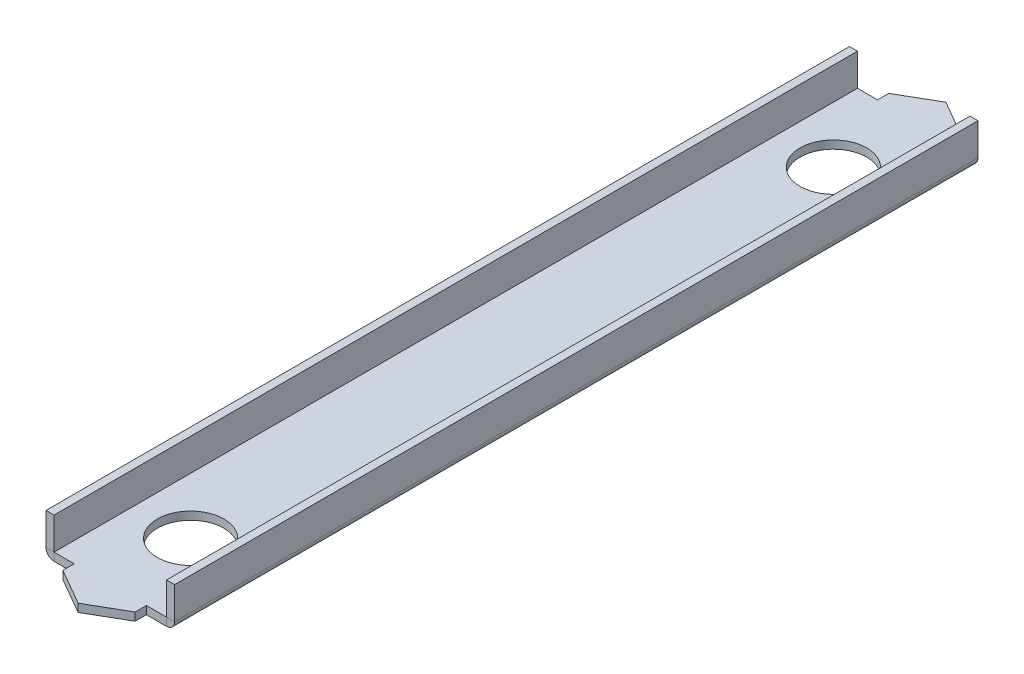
ISO-10303-21;
HEADER;
FILE_DESCRIPTION(('STEP AP214'),'2;1');
FILE_NAME('part.step','',(''),(''),'','','');
FILE_SCHEMA(('AUTOMOTIVE_DESIGN { 1 0 10303 214 1 1 1 1 }'));
ENDSEC;
DATA;
#1=APPLICATION_CONTEXT('core data for automotive mechanical design processes');
#2=APPLICATION_PROTOCOL_DEFINITION('international standard','automotive_design',2000,#1);
#3=PRODUCT_CONTEXT('',#1,'mechanical');
#4=PRODUCT('Part','Part','',(#3));
#5=PRODUCT_RELATED_PRODUCT_CATEGORY('part','',(#4));
#6=PRODUCT_DEFINITION_FORMATION('','',#4);
#7=PRODUCT_DEFINITION_CONTEXT('part definition',#1,'design');
#8=PRODUCT_DEFINITION('design','',#6,#7);
#9=PRODUCT_DEFINITION_SHAPE('','',#8);
#10=(LENGTH_UNIT() NAMED_UNIT(*) SI_UNIT(.MILLI.,.METRE.));
#11=(NAMED_UNIT(*) PLANE_ANGLE_UNIT() SI_UNIT($,.RADIAN.));
#12=(NAMED_UNIT(*) SI_UNIT($,.STERADIAN.) SOLID_ANGLE_UNIT());
#13=UNCERTAINTY_MEASURE_WITH_UNIT(LENGTH_MEASURE(1.E-05),#10,'distance_accuracy_value','');
#14=(GEOMETRIC_REPRESENTATION_CONTEXT(3) GLOBAL_UNCERTAINTY_ASSIGNED_CONTEXT((#13)) GLOBAL_UNIT_ASSIGNED_CONTEXT((#10,
#11,#12)) REPRESENTATION_CONTEXT('',''));
#15=CARTESIAN_POINT('',(0.,0.,0.));
#16=DIRECTION('',(0.,0.,1.));
#17=DIRECTION('',(1.,0.,0.));
#18=AXIS2_PLACEMENT_3D('',#15,#16,#17);
#19=CARTESIAN_POINT('',(-6.99899999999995,-2.28539816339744,50.));
#20=DIRECTION('',(0.,0.,1.));
#21=DIRECTION('',(0.,-1.,0.));
#22=AXIS2_PLACEMENT_3D('',#19,#20,#21);
#23=PLANE('',#22);
#24=DIRECTION('',(0.,1.,0.));
#25=VECTOR('',#24,1.);
#26=CARTESIAN_POINT('',(-8.00000000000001,-2.28539816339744,50.));
#27=LINE('',#26,#25);
#28=CARTESIAN_POINT('',(-8.00000000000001,1.,50.0000000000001));
#29=VERTEX_POINT('',#28);
#30=CARTESIAN_POINT('',(-8.00000000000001,5.00000000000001,50.0000000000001));
#31=VERTEX_POINT('',#30);
#32=EDGE_CURVE('E207',#29,#31,#27,.T.);
#33=ORIENTED_EDGE('',*,*,#32,.F.);
#34=DIRECTION('',(1.,0.,0.));
#35=VECTOR('',#34,1.);
#36=CARTESIAN_POINT('',(-6.99899999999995,1.,50.0000000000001));
#37=LINE('',#36,#35);
#38=CARTESIAN_POINT('',(-7.00000000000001,1.,50.0000000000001));
#39=VERTEX_POINT('',#38);
#40=EDGE_CURVE('E11',#29,#39,#37,.T.);
#41=ORIENTED_EDGE('',*,*,#40,.T.);
#42=DIRECTION('',(0.,1.,0.));
#43=VECTOR('',#42,1.);
#44=CARTESIAN_POINT('',(-7.00000000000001,-2.28539816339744,50.));
#45=LINE('',#44,#43);
#46=CARTESIAN_POINT('',(-7.00000000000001,5.00000000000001,50.0000000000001));
#47=VERTEX_POINT('',#46);
#48=EDGE_CURVE('E205',#39,#47,#45,.T.);
#49=ORIENTED_EDGE('',*,*,#48,.T.);
#50=DIRECTION('',(-1.,0.,0.));
#51=VECTOR('',#50,1.);
#52=CARTESIAN_POINT('',(-6.99899999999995,5.00000000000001,50.0000000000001));
#53=LINE('',#52,#51);
#54=EDGE_CURVE('E211',#47,#31,#53,.T.);
#55=ORIENTED_EDGE('',*,*,#54,.T.);
#56=EDGE_LOOP('',(#33,#41,#49,#55));
#57=FACE_BOUND('',#56,.T.);
#58=ADVANCED_FACE('F29',(#57),#23,.T.);
#59=CARTESIAN_POINT('',(-6.99899999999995,-2.28539816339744,-50.));
#60=DIRECTION('',(0.,0.,-1.));
#61=DIRECTION('',(0.,1.,0.));
#62=AXIS2_PLACEMENT_3D('',#59,#60,#61);
#63=PLANE('',#62);
#64=DIRECTION('',(0.,-1.,0.));
#65=VECTOR('',#64,1.);
#66=CARTESIAN_POINT('',(-7.00000000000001,-2.28539816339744,-50.));
#67=LINE('',#66,#65);
#68=CARTESIAN_POINT('',(-7.00000000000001,5.00000000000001,-50.));
#69=VERTEX_POINT('',#68);
#70=CARTESIAN_POINT('',(-7.00000000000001,1.,-50.));
#71=VERTEX_POINT('',#70);
#72=EDGE_CURVE('E224',#69,#71,#67,.T.);
#73=ORIENTED_EDGE('',*,*,#72,.T.);
#74=DIRECTION('',(-1.,0.,0.));
#75=VECTOR('',#74,1.);
#76=CARTESIAN_POINT('',(-6.99899999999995,1.,-50.));
#77=LINE('',#76,#75);
#78=CARTESIAN_POINT('',(-8.00000000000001,1.00000000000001,-50.));
#79=VERTEX_POINT('',#78);
#80=EDGE_CURVE('E37',#71,#79,#77,.T.);
#81=ORIENTED_EDGE('',*,*,#80,.T.);
#82=DIRECTION('',(0.,-1.,0.));
#83=VECTOR('',#82,1.);
#84=CARTESIAN_POINT('',(-8.00000000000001,-2.28539816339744,-50.));
#85=LINE('',#84,#83);
#86=CARTESIAN_POINT('',(-8.00000000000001,5.00000000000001,-50.));
#87=VERTEX_POINT('',#86);
#88=EDGE_CURVE('E219',#87,#79,#85,.T.);
#89=ORIENTED_EDGE('',*,*,#88,.F.);
#90=DIRECTION('',(-1.,0.,0.));
#91=VECTOR('',#90,1.);
#92=CARTESIAN_POINT('',(-6.99899999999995,5.00000000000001,-50.));
#93=LINE('',#92,#91);
#94=EDGE_CURVE('E222',#69,#87,#93,.T.);
#95=ORIENTED_EDGE('',*,*,#94,.F.);
#96=EDGE_LOOP('',(#73,#81,#89,#95));
#97=FACE_BOUND('',#96,.T.);
#98=ADVANCED_FACE('F232',(#97),#63,.T.);
#99=CARTESIAN_POINT('',(-8.00000000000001,0.,55.));
#100=DIRECTION('',(1.,0.,0.));
#101=DIRECTION('',(0.,0.,-1.));
#102=AXIS2_PLACEMENT_3D('',#99,#100,#101);
#103=PLANE('',#102);
#104=ORIENTED_EDGE('',*,*,#32,.T.);
#105=DIRECTION('',(0.,0.,-1.));
#106=VECTOR('',#105,1.);
#107=CARTESIAN_POINT('',(-8.00000000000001,5.,55.0000000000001));
#108=LINE('',#107,#106);
#109=EDGE_CURVE('E226',#31,#87,#108,.T.);
#110=ORIENTED_EDGE('',*,*,#109,.T.);
#111=ORIENTED_EDGE('',*,*,#88,.T.);
#112=DIRECTION('',(0.,0.,-1.));
#113=VECTOR('',#112,1.);
#114=CARTESIAN_POINT('',(-8.00000000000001,1.,55.0000000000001));
#115=LINE('',#114,#113);
#116=EDGE_CURVE('E44',#29,#79,#115,.T.);
#117=ORIENTED_EDGE('',*,*,#116,.F.);
#118=EDGE_LOOP('',(#104,#110,#111,#117));
#119=FACE_BOUND('',#118,.T.);
#120=ADVANCED_FACE('F236',(#119),#103,.F.);
#121=CARTESIAN_POINT('',(213.145406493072,5.,55.0000000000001));
#122=DIRECTION('',(0.,1.,0.));
#123=DIRECTION('',(-1.,0.,0.));
#124=AXIS2_PLACEMENT_3D('',#121,#122,#123);
#125=PLANE('',#124);
#126=ORIENTED_EDGE('',*,*,#109,.F.);
#127=ORIENTED_EDGE('',*,*,#54,.F.);
#128=DIRECTION('',(0.,0.,-1.));
#129=VECTOR('',#128,1.);
#130=CARTESIAN_POINT('',(-7.00000000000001,5.,55.0000000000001));
#131=LINE('',#130,#129);
#132=EDGE_CURVE('E52',#47,#69,#131,.T.);
#133=ORIENTED_EDGE('',*,*,#132,.T.);
#134=ORIENTED_EDGE('',*,*,#94,.T.);
#135=EDGE_LOOP('',(#126,#127,#133,#134));
#136=FACE_BOUND('',#135,.T.);
#137=ADVANCED_FACE('F31',(#136),#125,.T.);
#138=CARTESIAN_POINT('',(-7.00000000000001,0.,55.0000000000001));
#139=DIRECTION('',(1.,0.,0.));
#140=DIRECTION('',(0.,0.,-1.));
#141=AXIS2_PLACEMENT_3D('',#138,#139,#140);
#142=PLANE('',#141);
#143=ORIENTED_EDGE('',*,*,#132,.F.);
#144=ORIENTED_EDGE('',*,*,#48,.F.);
#145=DIRECTION('',(0.,0.,-1.));
#146=VECTOR('',#145,1.);
#147=CARTESIAN_POINT('',(-7.00000000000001,1.,55.0000000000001));
#148=LINE('',#147,#146);
#149=EDGE_CURVE('E171',#39,#71,#148,.T.);
#150=ORIENTED_EDGE('',*,*,#149,.T.);
#151=ORIENTED_EDGE('',*,*,#72,.F.);
#152=EDGE_LOOP('',(#143,#144,#150,#151));
#153=FACE_BOUND('',#152,.T.);
#154=ADVANCED_FACE('F208',(#153),#142,.T.);
#155=CARTESIAN_POINT('',(6.99899999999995,-2.28539816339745,50.0000000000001));
#156=DIRECTION('',(0.,0.,1.));
#157=DIRECTION('',(0.,1.,0.));
#158=AXIS2_PLACEMENT_3D('',#155,#156,#157);
#159=PLANE('',#158);
#160=DIRECTION('',(0.,-1.,0.));
#161=VECTOR('',#160,1.);
#162=CARTESIAN_POINT('',(7.00000000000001,-2.28539816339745,50.0000000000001));
#163=LINE('',#162,#161);
#164=CARTESIAN_POINT('',(7.00000000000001,5.,50.0000000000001));
#165=VERTEX_POINT('',#164);
#166=CARTESIAN_POINT('',(7.00000000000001,1.,50.0000000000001));
#167=VERTEX_POINT('',#166);
#168=EDGE_CURVE('E473',#165,#167,#163,.T.);
#169=ORIENTED_EDGE('',*,*,#168,.T.);
#170=DIRECTION('',(1.,0.,0.));
#171=VECTOR('',#170,1.);
#172=CARTESIAN_POINT('',(6.99899999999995,1.,50.0000000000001));
#173=LINE('',#172,#171);
#174=CARTESIAN_POINT('',(8.00000000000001,1.,50.0000000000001));
#175=VERTEX_POINT('',#174);
#176=EDGE_CURVE('E209',#167,#175,#173,.T.);
#177=ORIENTED_EDGE('',*,*,#176,.T.);
#178=DIRECTION('',(0.,-1.,0.));
#179=VECTOR('',#178,1.);
#180=CARTESIAN_POINT('',(8.00000000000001,-2.28539816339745,50.0000000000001));
#181=LINE('',#180,#179);
#182=CARTESIAN_POINT('',(8.00000000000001,5.,50.0000000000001));
#183=VERTEX_POINT('',#182);
#184=EDGE_CURVE('E200',#183,#175,#181,.T.);
#185=ORIENTED_EDGE('',*,*,#184,.F.);
#186=DIRECTION('',(1.,0.,0.));
#187=VECTOR('',#186,1.);
#188=CARTESIAN_POINT('',(6.99899999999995,5.,50.0000000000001));
#189=LINE('',#188,#187);
#190=EDGE_CURVE('E470',#165,#183,#189,.T.);
#191=ORIENTED_EDGE('',*,*,#190,.F.);
#192=EDGE_LOOP('',(#169,#177,#185,#191));
#193=FACE_BOUND('',#192,.T.);
#194=ADVANCED_FACE('F243',(#193),#159,.T.);
#195=CARTESIAN_POINT('',(6.99899999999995,-2.28539816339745,-49.9999999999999));
#196=DIRECTION('',(0.,0.,-1.));
#197=DIRECTION('',(0.,-1.,0.));
#198=AXIS2_PLACEMENT_3D('',#195,#196,#197);
#199=PLANE('',#198);
#200=DIRECTION('',(0.,1.,0.));
#201=VECTOR('',#200,1.);
#202=CARTESIAN_POINT('',(8.00000000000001,-2.28539816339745,-49.9999999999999));
#203=LINE('',#202,#201);
#204=CARTESIAN_POINT('',(8.00000000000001,1.00000000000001,-49.9999999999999));
#205=VERTEX_POINT('',#204);
#206=CARTESIAN_POINT('',(8.00000000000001,5.,-49.9999999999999));
#207=VERTEX_POINT('',#206);
#208=EDGE_CURVE('E479',#205,#207,#203,.T.);
#209=ORIENTED_EDGE('',*,*,#208,.F.);
#210=DIRECTION('',(-1.,0.,0.));
#211=VECTOR('',#210,1.);
#212=CARTESIAN_POINT('',(6.99899999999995,1.00000000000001,-49.9999999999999));
#213=LINE('',#212,#211);
#214=CARTESIAN_POINT('',(7.00000000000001,1.00000000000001,-49.9999999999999));
#215=VERTEX_POINT('',#214);
#216=EDGE_CURVE('E214',#205,#215,#213,.T.);
#217=ORIENTED_EDGE('',*,*,#216,.T.);
#218=DIRECTION('',(0.,1.,0.));
#219=VECTOR('',#218,1.);
#220=CARTESIAN_POINT('',(7.00000000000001,-2.28539816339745,-49.9999999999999));
#221=LINE('',#220,#219);
#222=CARTESIAN_POINT('',(7.00000000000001,5.,-49.9999999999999));
#223=VERTEX_POINT('',#222);
#224=EDGE_CURVE('E476',#215,#223,#221,.T.);
#225=ORIENTED_EDGE('',*,*,#224,.T.);
#226=DIRECTION('',(1.,0.,0.));
#227=VECTOR('',#226,1.);
#228=CARTESIAN_POINT('',(6.99899999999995,5.,-49.9999999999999));
#229=LINE('',#228,#227);
#230=EDGE_CURVE('E482',#223,#207,#229,.T.);
#231=ORIENTED_EDGE('',*,*,#230,.T.);
#232=EDGE_LOOP('',(#209,#217,#225,#231));
#233=FACE_BOUND('',#232,.T.);
#234=ADVANCED_FACE('F256',(#233),#199,.T.);
#235=CARTESIAN_POINT('',(-213.145406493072,5.,55.0000000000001));
#236=DIRECTION('',(0.,-1.,0.));
#237=DIRECTION('',(1.,0.,0.));
#238=AXIS2_PLACEMENT_3D('',#235,#236,#237);
#239=PLANE('',#238);
#240=ORIENTED_EDGE('',*,*,#190,.T.);
#241=DIRECTION('',(0.,0.,-1.));
#242=VECTOR('',#241,1.);
#243=CARTESIAN_POINT('',(8.00000000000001,5.,55.0000000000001));
#244=LINE('',#243,#242);
#245=EDGE_CURVE('E485',#183,#207,#244,.T.);
#246=ORIENTED_EDGE('',*,*,#245,.T.);
#247=ORIENTED_EDGE('',*,*,#230,.F.);
#248=DIRECTION('',(0.,0.,-1.));
#249=VECTOR('',#248,1.);
#250=CARTESIAN_POINT('',(7.00000000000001,5.,55.0000000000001));
#251=LINE('',#250,#249);
#252=EDGE_CURVE('E493',#165,#223,#251,.T.);
#253=ORIENTED_EDGE('',*,*,#252,.F.);
#254=EDGE_LOOP('',(#240,#246,#247,#253));
#255=FACE_BOUND('',#254,.T.);
#256=ADVANCED_FACE('F252',(#255),#239,.F.);
#257=CARTESIAN_POINT('',(7.00000000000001,0.,55.0000000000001));
#258=DIRECTION('',(-1.,0.,0.));
#259=DIRECTION('',(0.,0.,1.));
#260=AXIS2_PLACEMENT_3D('',#257,#258,#259);
#261=PLANE('',#260);
#262=DIRECTION('',(0.,0.,-1.));
#263=VECTOR('',#262,1.);
#264=CARTESIAN_POINT('',(7.00000000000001,1.,55.0000000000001));
#265=LINE('',#264,#263);
#266=EDGE_CURVE('E490',#167,#215,#265,.T.);
#267=ORIENTED_EDGE('',*,*,#266,.F.);
#268=ORIENTED_EDGE('',*,*,#168,.F.);
#269=ORIENTED_EDGE('',*,*,#252,.T.);
#270=ORIENTED_EDGE('',*,*,#224,.F.);
#271=EDGE_LOOP('',(#267,#268,#269,#270));
#272=FACE_BOUND('',#271,.T.);
#273=ADVANCED_FACE('F255',(#272),#261,.T.);
#274=CARTESIAN_POINT('',(8.00000000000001,0.,55.0000000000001));
#275=DIRECTION('',(-1.,0.,0.));
#276=DIRECTION('',(0.,0.,1.));
#277=AXIS2_PLACEMENT_3D('',#274,#275,#276);
#278=PLANE('',#277);
#279=ORIENTED_EDGE('',*,*,#184,.T.);
#280=DIRECTION('',(0.,0.,-1.));
#281=VECTOR('',#280,1.);
#282=CARTESIAN_POINT('',(8.00000000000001,1.,55.0000000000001));
#283=LINE('',#282,#281);
#284=EDGE_CURVE('E487',#175,#205,#283,.T.);
#285=ORIENTED_EDGE('',*,*,#284,.T.);
#286=ORIENTED_EDGE('',*,*,#208,.T.);
#287=ORIENTED_EDGE('',*,*,#245,.F.);
#288=EDGE_LOOP('',(#279,#285,#286,#287));
#289=FACE_BOUND('',#288,.T.);
#290=ADVANCED_FACE('F260',(#289),#278,.F.);
#291=CARTESIAN_POINT('',(-8.00000000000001,1.,55.0000000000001));
#292=DIRECTION('',(0.,1.,0.));
#293=DIRECTION('',(-1.,0.,0.));
#294=AXIS2_PLACEMENT_3D('',#291,#292,#293);
#295=PLANE('',#294);
#296=CARTESIAN_POINT('',(0.,1.00000000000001,-39.9999999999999));
#297=DIRECTION('',(0.,1.,0.));
#298=DIRECTION('',(-1.,0.,0.));
#299=AXIS2_PLACEMENT_3D('',#296,#297,#298);
#300=CIRCLE('',#299,4.15);
#301=CARTESIAN_POINT('',(-4.15,1.00000000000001,-39.9999999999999));
#302=VERTEX_POINT('',#301);
#303=EDGE_CURVE('E454',#302,#302,#300,.T.);
#304=ORIENTED_EDGE('',*,*,#303,.F.);
#305=EDGE_LOOP('',(#304));
#306=FACE_BOUND('',#305,.T.);
#307=CARTESIAN_POINT('',(0.,1.00000000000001,40.0000000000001));
#308=DIRECTION('',(0.,1.,0.));
#309=DIRECTION('',(-1.,0.,0.));
#310=AXIS2_PLACEMENT_3D('',#307,#308,#309);
#311=CIRCLE('',#310,4.15);
#312=CARTESIAN_POINT('',(-4.15,1.00000000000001,40.0000000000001));
#313=VERTEX_POINT('',#312);
#314=EDGE_CURVE('E448',#313,#313,#311,.T.);
#315=ORIENTED_EDGE('',*,*,#314,.F.);
#316=EDGE_LOOP('',(#315));
#317=FACE_BOUND('',#316,.T.);
#318=ORIENTED_EDGE('',*,*,#149,.F.);
#319=DIRECTION('',(-1.,0.,0.));
#320=VECTOR('',#319,1.);
#321=CARTESIAN_POINT('',(-4.5,1.00000000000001,50.0000000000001));
#322=LINE('',#321,#320);
#323=CARTESIAN_POINT('',(-4.5,1.00000000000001,50.0000000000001));
#324=VERTEX_POINT('',#323);
#325=EDGE_CURVE('E175',#324,#39,#322,.T.);
#326=ORIENTED_EDGE('',*,*,#325,.F.);
#327=DIRECTION('',(0.,0.,-1.));
#328=VECTOR('',#327,1.);
#329=CARTESIAN_POINT('',(-4.5,1.00000000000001,51.4019237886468));
#330=LINE('',#329,#328);
#331=CARTESIAN_POINT('',(-4.5,1.00000000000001,51.4019237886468));
#332=VERTEX_POINT('',#331);
#333=EDGE_CURVE('E194',#332,#324,#330,.T.);
#334=ORIENTED_EDGE('',*,*,#333,.F.);
#335=DIRECTION('',(-0.866025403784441,0.,-0.499999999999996));
#336=VECTOR('',#335,1.);
#337=CARTESIAN_POINT('',(0.,1.,54.0000000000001));
#338=LINE('',#337,#336);
#339=CARTESIAN_POINT('',(0.,1.,54.0000000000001));
#340=VERTEX_POINT('',#339);
#341=EDGE_CURVE('E370',#340,#332,#338,.T.);
#342=ORIENTED_EDGE('',*,*,#341,.F.);
#343=DIRECTION('',(-0.86602540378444,0.,0.499999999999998));
#344=VECTOR('',#343,1.);
#345=CARTESIAN_POINT('',(0.,1.,54.0000000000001));
#346=LINE('',#345,#344);
#347=CARTESIAN_POINT('',(4.5,1.00000000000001,51.4019237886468));
#348=VERTEX_POINT('',#347);
#349=EDGE_CURVE('E399',#348,#340,#346,.T.);
#350=ORIENTED_EDGE('',*,*,#349,.F.);
#351=DIRECTION('',(0.,0.,1.));
#352=VECTOR('',#351,1.);
#353=CARTESIAN_POINT('',(4.5,1.00000000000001,51.4019237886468));
#354=LINE('',#353,#352);
#355=CARTESIAN_POINT('',(4.5,1.00000000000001,50.0000000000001));
#356=VERTEX_POINT('',#355);
#357=EDGE_CURVE('E363',#356,#348,#354,.T.);
#358=ORIENTED_EDGE('',*,*,#357,.F.);
#359=DIRECTION('',(-1.,0.,0.));
#360=VECTOR('',#359,1.);
#361=CARTESIAN_POINT('',(4.5,1.00000000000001,50.0000000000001));
#362=LINE('',#361,#360);
#363=EDGE_CURVE('E367',#167,#356,#362,.T.);
#364=ORIENTED_EDGE('',*,*,#363,.F.);
#365=ORIENTED_EDGE('',*,*,#266,.T.);
#366=DIRECTION('',(1.,0.,0.));
#367=VECTOR('',#366,1.);
#368=CARTESIAN_POINT('',(4.5,1.00000000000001,-50.));
#369=LINE('',#368,#367);
#370=CARTESIAN_POINT('',(4.5,1.00000000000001,-50.));
#371=VERTEX_POINT('',#370);
#372=EDGE_CURVE('E412',#371,#215,#369,.T.);
#373=ORIENTED_EDGE('',*,*,#372,.F.);
#374=DIRECTION('',(0.,0.,1.));
#375=VECTOR('',#374,1.);
#376=CARTESIAN_POINT('',(4.5,1.00000000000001,-51.4019237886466));
#377=LINE('',#376,#375);
#378=CARTESIAN_POINT('',(4.5,1.00000000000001,-51.4019237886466));
#379=VERTEX_POINT('',#378);
#380=EDGE_CURVE('E409',#379,#371,#377,.T.);
#381=ORIENTED_EDGE('',*,*,#380,.F.);
#382=DIRECTION('',(0.86602540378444,0.,0.499999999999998));
#383=VECTOR('',#382,1.);
#384=CARTESIAN_POINT('',(0.,1.00000000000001,-54.));
#385=LINE('',#384,#383);
#386=CARTESIAN_POINT('',(0.,1.00000000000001,-54.));
#387=VERTEX_POINT('',#386);
#388=EDGE_CURVE('E406',#387,#379,#385,.T.);
#389=ORIENTED_EDGE('',*,*,#388,.F.);
#390=DIRECTION('',(0.866025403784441,0.,-0.499999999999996));
#391=VECTOR('',#390,1.);
#392=CARTESIAN_POINT('',(0.,1.00000000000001,-54.));
#393=LINE('',#392,#391);
#394=CARTESIAN_POINT('',(-4.5,1.00000000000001,-51.4019237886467));
#395=VERTEX_POINT('',#394);
#396=EDGE_CURVE('E403',#395,#387,#393,.T.);
#397=ORIENTED_EDGE('',*,*,#396,.F.);
#398=DIRECTION('',(0.,0.,-1.));
#399=VECTOR('',#398,1.);
#400=CARTESIAN_POINT('',(-4.5,1.00000000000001,-51.4019237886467));
#401=LINE('',#400,#399);
#402=CARTESIAN_POINT('',(-4.5,1.00000000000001,-50.));
#403=VERTEX_POINT('',#402);
#404=EDGE_CURVE('E442',#403,#395,#401,.T.);
#405=ORIENTED_EDGE('',*,*,#404,.F.);
#406=DIRECTION('',(1.,0.,0.));
#407=VECTOR('',#406,1.);
#408=CARTESIAN_POINT('',(-4.5,1.00000000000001,-50.));
#409=LINE('',#408,#407);
#410=EDGE_CURVE('E178',#71,#403,#409,.T.);
#411=ORIENTED_EDGE('',*,*,#410,.F.);
#412=EDGE_LOOP('',(#318,#326,#334,#342,#350,#358,#364,#365,#373,#381,#389,#397,#405,#411));
#413=FACE_BOUND('',#412,.T.);
#414=ADVANCED_FACE('F173',(#306,#317,#413),#295,.T.);
#415=CARTESIAN_POINT('',(-8.00000000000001,0.,55.));
#416=DIRECTION('',(0.,1.,0.));
#417=DIRECTION('',(-1.,0.,0.));
#418=AXIS2_PLACEMENT_3D('',#415,#416,#417);
#419=PLANE('',#418);
#420=CARTESIAN_POINT('',(0.,0.,-39.9999999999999));
#421=DIRECTION('',(0.,1.,0.));
#422=DIRECTION('',(0.,0.,1.));
#423=AXIS2_PLACEMENT_3D('',#420,#421,#422);
#424=CIRCLE('',#423,4.15);
#425=CARTESIAN_POINT('',(0.,0.,-35.8499999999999));
#426=VERTEX_POINT('',#425);
#427=EDGE_CURVE('E451',#426,#426,#424,.T.);
#428=ORIENTED_EDGE('',*,*,#427,.T.);
#429=EDGE_LOOP('',(#428));
#430=FACE_BOUND('',#429,.T.);
#431=CARTESIAN_POINT('',(0.,0.,40.0000000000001));
#432=DIRECTION('',(0.,1.,0.));
#433=DIRECTION('',(0.,0.,-1.));
#434=AXIS2_PLACEMENT_3D('',#431,#432,#433);
#435=CIRCLE('',#434,4.15);
#436=CARTESIAN_POINT('',(0.,0.,35.8500000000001));
#437=VERTEX_POINT('',#436);
#438=EDGE_CURVE('E445',#437,#437,#435,.T.);
#439=ORIENTED_EDGE('',*,*,#438,.T.);
#440=EDGE_LOOP('',(#439));
#441=FACE_BOUND('',#440,.T.);
#442=DIRECTION('',(-1.,0.,0.));
#443=VECTOR('',#442,1.);
#444=CARTESIAN_POINT('',(-4.5,0.,50.0000000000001));
#445=LINE('',#444,#443);
#446=CARTESIAN_POINT('',(-4.5,0.,50.0000000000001));
#447=VERTEX_POINT('',#446);
#448=CARTESIAN_POINT('',(-7.00000000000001,0.,50.0000000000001));
#449=VERTEX_POINT('',#448);
#450=EDGE_CURVE('E379',#447,#449,#445,.T.);
#451=ORIENTED_EDGE('',*,*,#450,.T.);
#452=DIRECTION('',(0.,0.,-1.));
#453=VECTOR('',#452,1.);
#454=CARTESIAN_POINT('',(-7.00000000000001,0.,55.0000000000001));
#455=LINE('',#454,#453);
#456=CARTESIAN_POINT('',(-7.00000000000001,0.,-50.));
#457=VERTEX_POINT('',#456);
#458=EDGE_CURVE('E354',#449,#457,#455,.T.);
#459=ORIENTED_EDGE('',*,*,#458,.T.);
#460=DIRECTION('',(1.,0.,0.));
#461=VECTOR('',#460,1.);
#462=CARTESIAN_POINT('',(-4.5,0.,-50.));
#463=LINE('',#462,#461);
#464=CARTESIAN_POINT('',(-4.5,0.,-50.));
#465=VERTEX_POINT('',#464);
#466=EDGE_CURVE('E426',#457,#465,#463,.T.);
#467=ORIENTED_EDGE('',*,*,#466,.T.);
#468=DIRECTION('',(0.,0.,-1.));
#469=VECTOR('',#468,1.);
#470=CARTESIAN_POINT('',(-4.5,0.,-51.4019237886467));
#471=LINE('',#470,#469);
#472=CARTESIAN_POINT('',(-4.5,0.,-51.4019237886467));
#473=VERTEX_POINT('',#472);
#474=EDGE_CURVE('E429',#465,#473,#471,.T.);
#475=ORIENTED_EDGE('',*,*,#474,.T.);
#476=DIRECTION('',(0.866025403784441,0.,-0.499999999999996));
#477=VECTOR('',#476,1.);
#478=CARTESIAN_POINT('',(0.,0.,-54.));
#479=LINE('',#478,#477);
#480=CARTESIAN_POINT('',(0.,0.,-54.));
#481=VERTEX_POINT('',#480);
#482=EDGE_CURVE('E414',#473,#481,#479,.T.);
#483=ORIENTED_EDGE('',*,*,#482,.T.);
#484=DIRECTION('',(0.86602540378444,0.,0.499999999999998));
#485=VECTOR('',#484,1.);
#486=CARTESIAN_POINT('',(0.,0.,-54.));
#487=LINE('',#486,#485);
#488=CARTESIAN_POINT('',(4.5,0.,-51.4019237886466));
#489=VERTEX_POINT('',#488);
#490=EDGE_CURVE('E417',#481,#489,#487,.T.);
#491=ORIENTED_EDGE('',*,*,#490,.T.);
#492=DIRECTION('',(0.,0.,1.));
#493=VECTOR('',#492,1.);
#494=CARTESIAN_POINT('',(4.5,0.,-51.4019237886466));
#495=LINE('',#494,#493);
#496=CARTESIAN_POINT('',(4.5,0.,-50.));
#497=VERTEX_POINT('',#496);
#498=EDGE_CURVE('E420',#489,#497,#495,.T.);
#499=ORIENTED_EDGE('',*,*,#498,.T.);
#500=DIRECTION('',(1.,0.,0.));
#501=VECTOR('',#500,1.);
#502=CARTESIAN_POINT('',(4.5,0.,-50.));
#503=LINE('',#502,#501);
#504=CARTESIAN_POINT('',(7.00000000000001,0.,-49.9999999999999));
#505=VERTEX_POINT('',#504);
#506=EDGE_CURVE('E423',#497,#505,#503,.T.);
#507=ORIENTED_EDGE('',*,*,#506,.T.);
#508=DIRECTION('',(0.,0.,-1.));
#509=VECTOR('',#508,1.);
#510=CARTESIAN_POINT('',(7.00000000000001,0.,55.0000000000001));
#511=LINE('',#510,#509);
#512=CARTESIAN_POINT('',(7.00000000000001,0.,50.0000000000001));
#513=VERTEX_POINT('',#512);
#514=EDGE_CURVE('E458',#513,#505,#511,.T.);
#515=ORIENTED_EDGE('',*,*,#514,.F.);
#516=DIRECTION('',(-1.,0.,0.));
#517=VECTOR('',#516,1.);
#518=CARTESIAN_POINT('',(4.5,0.,50.0000000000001));
#519=LINE('',#518,#517);
#520=CARTESIAN_POINT('',(4.5,0.,50.0000000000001));
#521=VERTEX_POINT('',#520);
#522=EDGE_CURVE('E381',#513,#521,#519,.T.);
#523=ORIENTED_EDGE('',*,*,#522,.T.);
#524=DIRECTION('',(0.,0.,1.));
#525=VECTOR('',#524,1.);
#526=CARTESIAN_POINT('',(4.5,0.,51.4019237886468));
#527=LINE('',#526,#525);
#528=CARTESIAN_POINT('',(4.5,0.,51.4019237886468));
#529=VERTEX_POINT('',#528);
#530=EDGE_CURVE('E384',#521,#529,#527,.T.);
#531=ORIENTED_EDGE('',*,*,#530,.T.);
#532=DIRECTION('',(-0.86602540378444,0.,0.499999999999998));
#533=VECTOR('',#532,1.);
#534=CARTESIAN_POINT('',(0.,0.,54.0000000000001));
#535=LINE('',#534,#533);
#536=CARTESIAN_POINT('',(0.,0.,54.0000000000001));
#537=VERTEX_POINT('',#536);
#538=EDGE_CURVE('E387',#529,#537,#535,.T.);
#539=ORIENTED_EDGE('',*,*,#538,.T.);
#540=DIRECTION('',(-0.866025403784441,0.,-0.499999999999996));
#541=VECTOR('',#540,1.);
#542=CARTESIAN_POINT('',(0.,0.,54.0000000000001));
#543=LINE('',#542,#541);
#544=CARTESIAN_POINT('',(-4.5,0.,51.4019237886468));
#545=VERTEX_POINT('',#544);
#546=EDGE_CURVE('E193',#537,#545,#543,.T.);
#547=ORIENTED_EDGE('',*,*,#546,.T.);
#548=DIRECTION('',(0.,0.,-1.));
#549=VECTOR('',#548,1.);
#550=CARTESIAN_POINT('',(-4.5,0.,51.4019237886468));
#551=LINE('',#550,#549);
#552=EDGE_CURVE('E376',#545,#447,#551,.T.);
#553=ORIENTED_EDGE('',*,*,#552,.T.);
#554=EDGE_LOOP('',(#451,#459,#467,#475,#483,#491,#499,#507,#515,#523,#531,#539,#547,#553));
#555=FACE_BOUND('',#554,.T.);
#556=ADVANCED_FACE('F273',(#430,#441,#555),#419,.F.);
#557=CARTESIAN_POINT('',(0.,1.00100000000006,-39.9999999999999));
#558=DIRECTION('',(0.,-1.,0.));
#559=DIRECTION('',(0.,0.,-1.));
#560=AXIS2_PLACEMENT_3D('',#557,#558,#559);
#561=CYLINDRICAL_SURFACE('',#560,4.15);
#562=ORIENTED_EDGE('',*,*,#303,.T.);
#563=EDGE_LOOP('',(#562));
#564=FACE_BOUND('',#563,.T.);
#565=ORIENTED_EDGE('',*,*,#427,.F.);
#566=EDGE_LOOP('',(#565));
#567=FACE_BOUND('',#566,.T.);
#568=ADVANCED_FACE('F277',(#564,#567),#561,.F.);
#569=CARTESIAN_POINT('',(0.,1.00100000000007,40.0000000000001));
#570=DIRECTION('',(0.,-1.,0.));
#571=DIRECTION('',(0.,0.,-1.));
#572=AXIS2_PLACEMENT_3D('',#569,#570,#571);
#573=CYLINDRICAL_SURFACE('',#572,4.15);
#574=ORIENTED_EDGE('',*,*,#314,.T.);
#575=EDGE_LOOP('',(#574));
#576=FACE_BOUND('',#575,.T.);
#577=ORIENTED_EDGE('',*,*,#438,.F.);
#578=EDGE_LOOP('',(#577));
#579=FACE_BOUND('',#578,.T.);
#580=ADVANCED_FACE('F281',(#576,#579),#573,.F.);
#581=CARTESIAN_POINT('',(0.,1.00100000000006,-54.));
#582=DIRECTION('',(-0.499999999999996,0.,-0.866025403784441));
#583=DIRECTION('',(-0.866025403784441,0.,0.499999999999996));
#584=AXIS2_PLACEMENT_3D('',#581,#582,#583);
#585=PLANE('',#584);
#586=ORIENTED_EDGE('',*,*,#396,.T.);
#587=DIRECTION('',(0.,-1.,0.));
#588=VECTOR('',#587,1.);
#589=CARTESIAN_POINT('',(0.,1.00100000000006,-54.));
#590=LINE('',#589,#588);
#591=EDGE_CURVE('E440',#387,#481,#590,.T.);
#592=ORIENTED_EDGE('',*,*,#591,.T.);
#593=ORIENTED_EDGE('',*,*,#482,.F.);
#594=DIRECTION('',(0.,-1.,0.));
#595=VECTOR('',#594,1.);
#596=CARTESIAN_POINT('',(-4.5,1.00100000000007,-51.4019237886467));
#597=LINE('',#596,#595);
#598=EDGE_CURVE('E432',#395,#473,#597,.T.);
#599=ORIENTED_EDGE('',*,*,#598,.F.);
#600=EDGE_LOOP('',(#586,#592,#593,#599));
#601=FACE_BOUND('',#600,.T.);
#602=ADVANCED_FACE('F285',(#601),#585,.T.);
#603=CARTESIAN_POINT('',(0.,1.00100000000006,-54.));
#604=DIRECTION('',(0.499999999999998,0.,-0.86602540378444));
#605=DIRECTION('',(-0.86602540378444,0.,-0.499999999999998));
#606=AXIS2_PLACEMENT_3D('',#603,#604,#605);
#607=PLANE('',#606);
#608=ORIENTED_EDGE('',*,*,#388,.T.);
#609=DIRECTION('',(0.,-1.,0.));
#610=VECTOR('',#609,1.);
#611=CARTESIAN_POINT('',(4.5,1.00100000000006,-51.4019237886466));
#612=LINE('',#611,#610);
#613=EDGE_CURVE('E438',#379,#489,#612,.T.);
#614=ORIENTED_EDGE('',*,*,#613,.T.);
#615=ORIENTED_EDGE('',*,*,#490,.F.);
#616=ORIENTED_EDGE('',*,*,#591,.F.);
#617=EDGE_LOOP('',(#608,#614,#615,#616));
#618=FACE_BOUND('',#617,.T.);
#619=ADVANCED_FACE('F289',(#618),#607,.T.);
#620=CARTESIAN_POINT('',(4.5,1.00100000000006,-51.4019237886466));
#621=DIRECTION('',(1.,0.,0.));
#622=DIRECTION('',(0.,0.,-1.));
#623=AXIS2_PLACEMENT_3D('',#620,#621,#622);
#624=PLANE('',#623);
#625=ORIENTED_EDGE('',*,*,#380,.T.);
#626=DIRECTION('',(0.,-1.,0.));
#627=VECTOR('',#626,1.);
#628=CARTESIAN_POINT('',(4.5,1.00100000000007,-50.));
#629=LINE('',#628,#627);
#630=EDGE_CURVE('E436',#371,#497,#629,.T.);
#631=ORIENTED_EDGE('',*,*,#630,.T.);
#632=ORIENTED_EDGE('',*,*,#498,.F.);
#633=ORIENTED_EDGE('',*,*,#613,.F.);
#634=EDGE_LOOP('',(#625,#631,#632,#633));
#635=FACE_BOUND('',#634,.T.);
#636=ADVANCED_FACE('F293',(#635),#624,.T.);
#637=CARTESIAN_POINT('',(4.5,1.00100000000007,-50.));
#638=DIRECTION('',(0.,0.,-1.));
#639=DIRECTION('',(-1.,0.,0.));
#640=AXIS2_PLACEMENT_3D('',#637,#638,#639);
#641=PLANE('',#640);
#642=DIRECTION('',(0.,1.,0.));
#643=VECTOR('',#642,1.);
#644=CARTESIAN_POINT('',(7.00000000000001,1.00100000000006,-49.9999999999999));
#645=LINE('',#644,#643);
#646=EDGE_CURVE('E461',#505,#215,#645,.T.);
#647=ORIENTED_EDGE('',*,*,#646,.F.);
#648=ORIENTED_EDGE('',*,*,#506,.F.);
#649=ORIENTED_EDGE('',*,*,#630,.F.);
#650=ORIENTED_EDGE('',*,*,#372,.T.);
#651=EDGE_LOOP('',(#647,#648,#649,#650));
#652=FACE_BOUND('',#651,.T.);
#653=ADVANCED_FACE('F297',(#652),#641,.T.);
#654=CARTESIAN_POINT('',(-4.5,1.00100000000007,-50.));
#655=DIRECTION('',(0.,0.,-1.));
#656=DIRECTION('',(-1.,0.,0.));
#657=AXIS2_PLACEMENT_3D('',#654,#655,#656);
#658=PLANE('',#657);
#659=DIRECTION('',(0.,-1.,0.));
#660=VECTOR('',#659,1.);
#661=CARTESIAN_POINT('',(-7.00000000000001,1.00100000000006,-50.));
#662=LINE('',#661,#660);
#663=EDGE_CURVE('E201',#71,#457,#662,.T.);
#664=ORIENTED_EDGE('',*,*,#663,.F.);
#665=ORIENTED_EDGE('',*,*,#410,.T.);
#666=DIRECTION('',(0.,-1.,0.));
#667=VECTOR('',#666,1.);
#668=CARTESIAN_POINT('',(-4.5,1.00100000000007,-50.));
#669=LINE('',#668,#667);
#670=EDGE_CURVE('E434',#403,#465,#669,.T.);
#671=ORIENTED_EDGE('',*,*,#670,.T.);
#672=ORIENTED_EDGE('',*,*,#466,.F.);
#673=EDGE_LOOP('',(#664,#665,#671,#672));
#674=FACE_BOUND('',#673,.T.);
#675=ADVANCED_FACE('F301',(#674),#658,.T.);
#676=CARTESIAN_POINT('',(-4.5,1.00100000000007,-51.4019237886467));
#677=DIRECTION('',(-1.,0.,0.));
#678=DIRECTION('',(0.,0.,1.));
#679=AXIS2_PLACEMENT_3D('',#676,#677,#678);
#680=PLANE('',#679);
#681=ORIENTED_EDGE('',*,*,#404,.T.);
#682=ORIENTED_EDGE('',*,*,#598,.T.);
#683=ORIENTED_EDGE('',*,*,#474,.F.);
#684=ORIENTED_EDGE('',*,*,#670,.F.);
#685=EDGE_LOOP('',(#681,#682,#683,#684));
#686=FACE_BOUND('',#685,.T.);
#687=ADVANCED_FACE('F305',(#686),#680,.T.);
#688=CARTESIAN_POINT('',(0.,1.00100000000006,54.0000000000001));
#689=DIRECTION('',(-0.499999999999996,0.,0.866025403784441));
#690=DIRECTION('',(0.866025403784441,0.,0.499999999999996));
#691=AXIS2_PLACEMENT_3D('',#688,#689,#690);
#692=PLANE('',#691);
#693=ORIENTED_EDGE('',*,*,#341,.T.);
#694=DIRECTION('',(0.,-1.,0.));
#695=VECTOR('',#694,1.);
#696=CARTESIAN_POINT('',(-4.5,1.00100000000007,51.4019237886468));
#697=LINE('',#696,#695);
#698=EDGE_CURVE('E397',#332,#545,#697,.T.);
#699=ORIENTED_EDGE('',*,*,#698,.T.);
#700=ORIENTED_EDGE('',*,*,#546,.F.);
#701=DIRECTION('',(0.,-1.,0.));
#702=VECTOR('',#701,1.);
#703=CARTESIAN_POINT('',(0.,1.00100000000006,54.0000000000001));
#704=LINE('',#703,#702);
#705=EDGE_CURVE('E390',#340,#537,#704,.T.);
#706=ORIENTED_EDGE('',*,*,#705,.F.);
#707=EDGE_LOOP('',(#693,#699,#700,#706));
#708=FACE_BOUND('',#707,.T.);
#709=ADVANCED_FACE('F309',(#708),#692,.T.);
#710=CARTESIAN_POINT('',(-4.5,1.00100000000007,51.4019237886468));
#711=DIRECTION('',(-1.,0.,0.));
#712=DIRECTION('',(0.,0.,1.));
#713=AXIS2_PLACEMENT_3D('',#710,#711,#712);
#714=PLANE('',#713);
#715=ORIENTED_EDGE('',*,*,#333,.T.);
#716=DIRECTION('',(0.,-1.,0.));
#717=VECTOR('',#716,1.);
#718=CARTESIAN_POINT('',(-4.5,1.00100000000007,50.0000000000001));
#719=LINE('',#718,#717);
#720=EDGE_CURVE('E191',#324,#447,#719,.T.);
#721=ORIENTED_EDGE('',*,*,#720,.T.);
#722=ORIENTED_EDGE('',*,*,#552,.F.);
#723=ORIENTED_EDGE('',*,*,#698,.F.);
#724=EDGE_LOOP('',(#715,#721,#722,#723));
#725=FACE_BOUND('',#724,.T.);
#726=ADVANCED_FACE('F313',(#725),#714,.T.);
#727=CARTESIAN_POINT('',(-4.5,1.00100000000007,50.0000000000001));
#728=DIRECTION('',(0.,0.,1.));
#729=DIRECTION('',(1.,0.,0.));
#730=AXIS2_PLACEMENT_3D('',#727,#728,#729);
#731=PLANE('',#730);
#732=DIRECTION('',(0.,1.,0.));
#733=VECTOR('',#732,1.);
#734=CARTESIAN_POINT('',(-7.00000000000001,1.00100000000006,50.0000000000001));
#735=LINE('',#734,#733);
#736=EDGE_CURVE('E189',#449,#39,#735,.T.);
#737=ORIENTED_EDGE('',*,*,#736,.F.);
#738=ORIENTED_EDGE('',*,*,#450,.F.);
#739=ORIENTED_EDGE('',*,*,#720,.F.);
#740=ORIENTED_EDGE('',*,*,#325,.T.);
#741=EDGE_LOOP('',(#737,#738,#739,#740));
#742=FACE_BOUND('',#741,.T.);
#743=ADVANCED_FACE('F187',(#742),#731,.T.);
#744=CARTESIAN_POINT('',(4.5,1.00100000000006,50.0000000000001));
#745=DIRECTION('',(0.,0.,1.));
#746=DIRECTION('',(1.,0.,0.));
#747=AXIS2_PLACEMENT_3D('',#744,#745,#746);
#748=PLANE('',#747);
#749=DIRECTION('',(0.,-1.,0.));
#750=VECTOR('',#749,1.);
#751=CARTESIAN_POINT('',(7.00000000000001,1.00100000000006,50.0000000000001));
#752=LINE('',#751,#750);
#753=EDGE_CURVE('E464',#167,#513,#752,.T.);
#754=ORIENTED_EDGE('',*,*,#753,.F.);
#755=ORIENTED_EDGE('',*,*,#363,.T.);
#756=DIRECTION('',(0.,-1.,0.));
#757=VECTOR('',#756,1.);
#758=CARTESIAN_POINT('',(4.5,1.00100000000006,50.0000000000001));
#759=LINE('',#758,#757);
#760=EDGE_CURVE('E394',#356,#521,#759,.T.);
#761=ORIENTED_EDGE('',*,*,#760,.T.);
#762=ORIENTED_EDGE('',*,*,#522,.F.);
#763=EDGE_LOOP('',(#754,#755,#761,#762));
#764=FACE_BOUND('',#763,.T.);
#765=ADVANCED_FACE('F320',(#764),#748,.T.);
#766=CARTESIAN_POINT('',(4.5,1.00100000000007,51.4019237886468));
#767=DIRECTION('',(1.,0.,0.));
#768=DIRECTION('',(0.,0.,-1.));
#769=AXIS2_PLACEMENT_3D('',#766,#767,#768);
#770=PLANE('',#769);
#771=ORIENTED_EDGE('',*,*,#357,.T.);
#772=DIRECTION('',(0.,-1.,0.));
#773=VECTOR('',#772,1.);
#774=CARTESIAN_POINT('',(4.5,1.00100000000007,51.4019237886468));
#775=LINE('',#774,#773);
#776=EDGE_CURVE('E392',#348,#529,#775,.T.);
#777=ORIENTED_EDGE('',*,*,#776,.T.);
#778=ORIENTED_EDGE('',*,*,#530,.F.);
#779=ORIENTED_EDGE('',*,*,#760,.F.);
#780=EDGE_LOOP('',(#771,#777,#778,#779));
#781=FACE_BOUND('',#780,.T.);
#782=ADVANCED_FACE('F323',(#781),#770,.T.);
#783=CARTESIAN_POINT('',(0.,1.00100000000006,54.0000000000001));
#784=DIRECTION('',(0.499999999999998,0.,0.86602540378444));
#785=DIRECTION('',(0.86602540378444,0.,-0.499999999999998));
#786=AXIS2_PLACEMENT_3D('',#783,#784,#785);
#787=PLANE('',#786);
#788=ORIENTED_EDGE('',*,*,#349,.T.);
#789=ORIENTED_EDGE('',*,*,#705,.T.);
#790=ORIENTED_EDGE('',*,*,#538,.F.);
#791=ORIENTED_EDGE('',*,*,#776,.F.);
#792=EDGE_LOOP('',(#788,#789,#790,#791));
#793=FACE_BOUND('',#792,.T.);
#794=ADVANCED_FACE('F327',(#793),#787,.T.);
#795=CARTESIAN_POINT('',(7.00000000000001,1.00000000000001,-49.9999999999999));
#796=DIRECTION('',(0.,0.,1.));
#797=DIRECTION('',(1.,0.,0.));
#798=AXIS2_PLACEMENT_3D('',#795,#796,#797);
#799=PLANE('',#798);
#800=ORIENTED_EDGE('',*,*,#646,.T.);
#801=ORIENTED_EDGE('',*,*,#216,.F.);
#802=CARTESIAN_POINT('',(7.00000000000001,1.00000000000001,-49.9999999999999));
#803=DIRECTION('',(0.,0.,1.));
#804=DIRECTION('',(1.,0.,0.));
#805=AXIS2_PLACEMENT_3D('',#802,#803,#804);
#806=CIRCLE('',#805,1.);
#807=EDGE_CURVE('E360',#205,#505,#806,.F.);
#808=ORIENTED_EDGE('',*,*,#807,.T.);
#809=EDGE_LOOP('',(#800,#801,#808));
#810=FACE_BOUND('',#809,.T.);
#811=ADVANCED_FACE('F331',(#810),#799,.F.);
#812=CARTESIAN_POINT('',(7.00000000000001,1.,50.0000000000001));
#813=DIRECTION('',(0.,0.,-1.));
#814=DIRECTION('',(-1.,0.,0.));
#815=AXIS2_PLACEMENT_3D('',#812,#813,#814);
#816=PLANE('',#815);
#817=ORIENTED_EDGE('',*,*,#176,.F.);
#818=ORIENTED_EDGE('',*,*,#753,.T.);
#819=CARTESIAN_POINT('',(7.00000000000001,1.,50.0000000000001));
#820=DIRECTION('',(0.,0.,-1.));
#821=DIRECTION('',(-1.,0.,0.));
#822=AXIS2_PLACEMENT_3D('',#819,#820,#821);
#823=CIRCLE('',#822,1.);
#824=EDGE_CURVE('E357',#513,#175,#823,.F.);
#825=ORIENTED_EDGE('',*,*,#824,.T.);
#826=EDGE_LOOP('',(#817,#818,#825));
#827=FACE_BOUND('',#826,.T.);
#828=ADVANCED_FACE('F335',(#827),#816,.F.);
#829=CARTESIAN_POINT('',(7.00000000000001,1.,167.501477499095));
#830=DIRECTION('',(0.,0.,-1.));
#831=DIRECTION('',(-1.,0.,0.));
#832=AXIS2_PLACEMENT_3D('',#829,#830,#831);
#833=CYLINDRICAL_SURFACE('',#832,1.);
#834=ORIENTED_EDGE('',*,*,#824,.F.);
#835=ORIENTED_EDGE('',*,*,#514,.T.);
#836=ORIENTED_EDGE('',*,*,#807,.F.);
#837=ORIENTED_EDGE('',*,*,#284,.F.);
#838=EDGE_LOOP('',(#834,#835,#836,#837));
#839=FACE_BOUND('',#838,.T.);
#840=ADVANCED_FACE('F339',(#839),#833,.T.);
#841=CARTESIAN_POINT('',(-7.00000000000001,1.,-50.));
#842=DIRECTION('',(0.,0.,1.));
#843=DIRECTION('',(1.,0.,0.));
#844=AXIS2_PLACEMENT_3D('',#841,#842,#843);
#845=PLANE('',#844);
#846=ORIENTED_EDGE('',*,*,#80,.F.);
#847=ORIENTED_EDGE('',*,*,#663,.T.);
#848=CARTESIAN_POINT('',(-7.00000000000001,1.,-50.));
#849=DIRECTION('',(0.,0.,1.));
#850=DIRECTION('',(1.,0.,0.));
#851=AXIS2_PLACEMENT_3D('',#848,#849,#850);
#852=CIRCLE('',#851,1.);
#853=EDGE_CURVE('E355',#457,#79,#852,.F.);
#854=ORIENTED_EDGE('',*,*,#853,.T.);
#855=EDGE_LOOP('',(#846,#847,#854));
#856=FACE_BOUND('',#855,.T.);
#857=ADVANCED_FACE('F343',(#856),#845,.F.);
#858=CARTESIAN_POINT('',(-7.00000000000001,1.,50.0000000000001));
#859=DIRECTION('',(0.,0.,-1.));
#860=DIRECTION('',(-1.,0.,0.));
#861=AXIS2_PLACEMENT_3D('',#858,#859,#860);
#862=PLANE('',#861);
#863=ORIENTED_EDGE('',*,*,#736,.T.);
#864=ORIENTED_EDGE('',*,*,#40,.F.);
#865=CARTESIAN_POINT('',(-7.00000000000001,1.,50.0000000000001));
#866=DIRECTION('',(0.,0.,-1.));
#867=DIRECTION('',(-1.,0.,0.));
#868=AXIS2_PLACEMENT_3D('',#865,#866,#867);
#869=CIRCLE('',#868,1.);
#870=EDGE_CURVE('E199',#29,#449,#869,.F.);
#871=ORIENTED_EDGE('',*,*,#870,.T.);
#872=EDGE_LOOP('',(#863,#864,#871));
#873=FACE_BOUND('',#872,.T.);
#874=ADVANCED_FACE('F198',(#873),#862,.F.);
#875=CARTESIAN_POINT('',(-7.00000000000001,1.,-166.87699486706));
#876=DIRECTION('',(0.,0.,1.));
#877=DIRECTION('',(1.,0.,0.));
#878=AXIS2_PLACEMENT_3D('',#875,#876,#877);
#879=CYLINDRICAL_SURFACE('',#878,1.);
#880=ORIENTED_EDGE('',*,*,#870,.F.);
#881=ORIENTED_EDGE('',*,*,#116,.T.);
#882=ORIENTED_EDGE('',*,*,#853,.F.);
#883=ORIENTED_EDGE('',*,*,#458,.F.);
#884=EDGE_LOOP('',(#880,#881,#882,#883));
#885=FACE_BOUND('',#884,.T.);
#886=ADVANCED_FACE('F349',(#885),#879,.T.);
#887=CLOSED_SHELL('',(#58,#98,#120,#137,#154,#194,#234,#256,#273,#290,#414,#556,#568,#580,#602,
#619,#636,#653,#675,#687,#709,#726,#743,#765,#782,#794,#811,#828,#840,#857,#874,#886));
#888=MANIFOLD_SOLID_BREP('B2',#887);
#889=ADVANCED_BREP_SHAPE_REPRESENTATION('',(#18,#888),#14);
#890=SHAPE_DEFINITION_REPRESENTATION(#9,#889);
ENDSEC;
END-ISO-10303-21;
